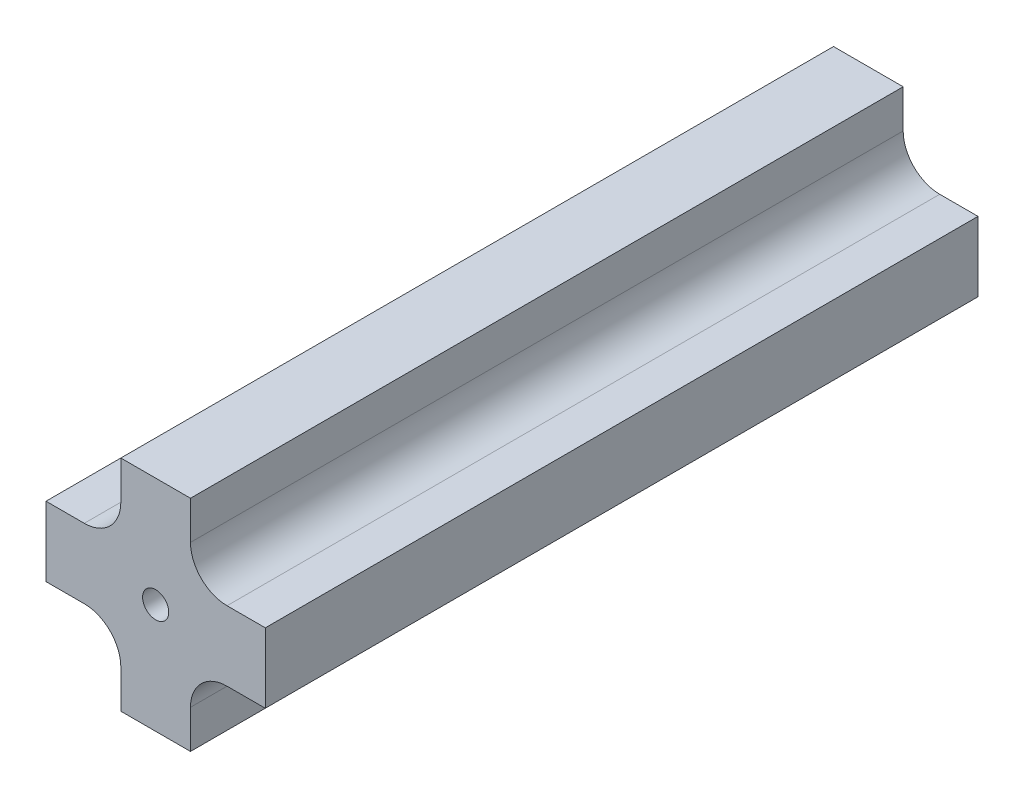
from build123d import *

# Parameters (mm, degrees)
SKETCH1_R      = 4.7625
EXTRUDE1_DEPTH = 260


with BuildPart() as part:
    # Sketch1 → Extrude1 (new body)
    with BuildSketch(Plane.XY):
        with BuildLine():
            Line((26.042742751, -12.706882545), (40.005, -12.706882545))
            Line((40.005, -12.706882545), (40.005, 12.706882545))
            Line((40.005, 12.706882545), (26.042742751, 12.706882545))
            ThreePointArc((26.042742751, 12.706882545), (16.612865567, 16.612865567), (12.706882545, 26.042742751))
            Line((12.706882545, 26.042742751), (12.706882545, 40.005))
            Line((12.706882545, 40.005), (-12.706882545, 40.005))
            Line((-12.706882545, 40.005), (-12.706882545, 26.042742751))
            ThreePointArc((-12.706882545, 26.042742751), (-16.612865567, 16.612865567), (-26.042742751, 12.706882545))
            Line((-26.042742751, 12.706882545), (-40.005, 12.706882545))
            Line((-40.005, 12.706882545), (-40.005, -12.706882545))
            Line((-40.005, -12.706882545), (-26.042742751, -12.706882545))
            ThreePointArc((-26.042742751, -12.706882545), (-16.612865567, -16.612865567), (-12.706882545, -26.042742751))
            Line((-12.706882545, -26.042742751), (-12.706882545, -40.005))
            Line((-12.706882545, -40.005), (12.706882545, -40.005))
            Line((12.706882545, -40.005), (12.706882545, -26.042742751))
            ThreePointArc((12.706882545, -26.042742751), (16.612865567, -16.612865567), (26.042742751, -12.706882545))
        make_face()
        Circle(SKETCH1_R, mode=Mode.SUBTRACT)
    extrude(amount=EXTRUDE1_DEPTH)


solid = part.part
